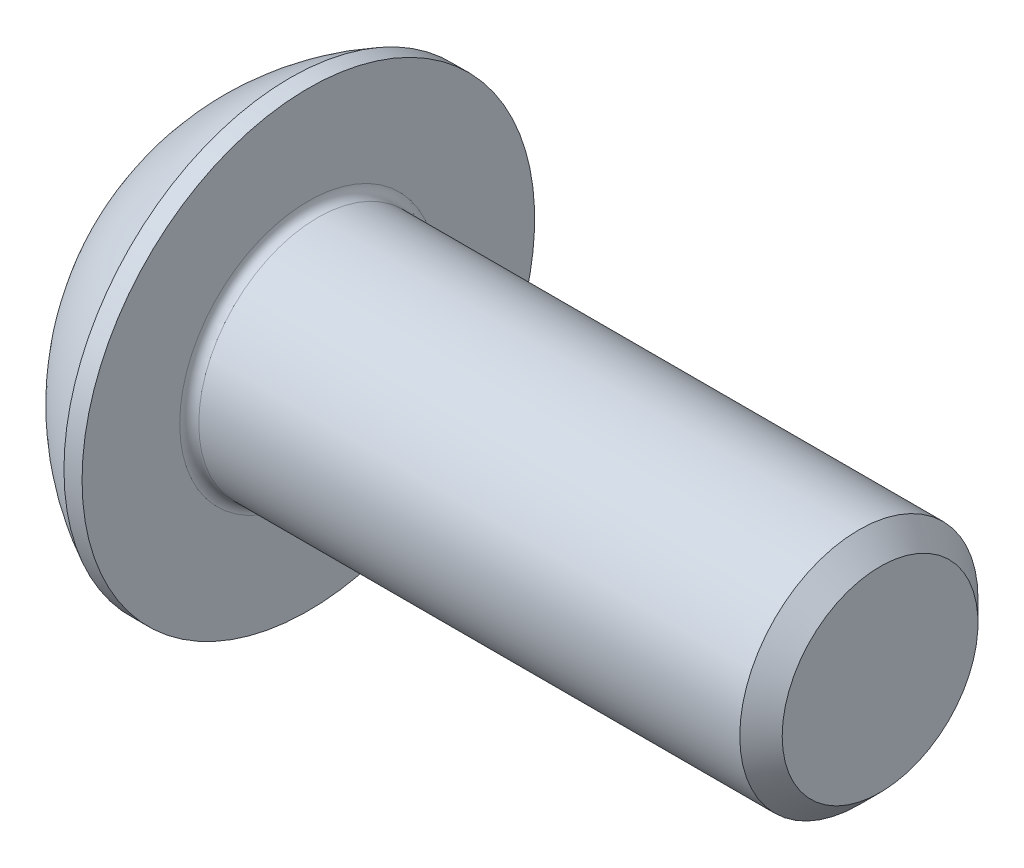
ISO-10303-21;
HEADER;
FILE_DESCRIPTION(('STEP AP214'),'2;1');
FILE_NAME('part.step','',(''),(''),'','','');
FILE_SCHEMA(('AUTOMOTIVE_DESIGN { 1 0 10303 214 1 1 1 1 }'));
ENDSEC;
DATA;
#1=APPLICATION_CONTEXT('core data for automotive mechanical design processes');
#2=APPLICATION_PROTOCOL_DEFINITION('international standard','automotive_design',2000,#1);
#3=PRODUCT_CONTEXT('',#1,'mechanical');
#4=PRODUCT('Part','Part','',(#3));
#5=PRODUCT_RELATED_PRODUCT_CATEGORY('part','',(#4));
#6=PRODUCT_DEFINITION_FORMATION('','',#4);
#7=PRODUCT_DEFINITION_CONTEXT('part definition',#1,'design');
#8=PRODUCT_DEFINITION('design','',#6,#7);
#9=PRODUCT_DEFINITION_SHAPE('','',#8);
#10=(LENGTH_UNIT() NAMED_UNIT(*) SI_UNIT(.MILLI.,.METRE.));
#11=(NAMED_UNIT(*) PLANE_ANGLE_UNIT() SI_UNIT($,.RADIAN.));
#12=(NAMED_UNIT(*) SI_UNIT($,.STERADIAN.) SOLID_ANGLE_UNIT());
#13=UNCERTAINTY_MEASURE_WITH_UNIT(LENGTH_MEASURE(1.E-05),#10,'distance_accuracy_value','');
#14=(GEOMETRIC_REPRESENTATION_CONTEXT(3) GLOBAL_UNCERTAINTY_ASSIGNED_CONTEXT((#13)) GLOBAL_UNIT_ASSIGNED_CONTEXT((#10,
#11,#12)) REPRESENTATION_CONTEXT('',''));
#15=CARTESIAN_POINT('',(0.,0.,0.));
#16=DIRECTION('',(0.,0.,1.));
#17=DIRECTION('',(1.,0.,0.));
#18=AXIS2_PLACEMENT_3D('',#15,#16,#17);
#19=CARTESIAN_POINT('',(0.,0.,0.));
#20=DIRECTION('',(-1.,0.,0.));
#21=DIRECTION('',(0.,0.,1.));
#22=AXIS2_PLACEMENT_3D('',#19,#20,#21);
#23=PLANE('',#22);
#24=CARTESIAN_POINT('',(0.,0.,0.));
#25=DIRECTION('',(-1.,0.,0.));
#26=DIRECTION('',(0.,0.,1.));
#27=AXIS2_PLACEMENT_3D('',#24,#25,#26);
#28=CIRCLE('',#27,2.375);
#29=CARTESIAN_POINT('',(0.,2.375,0.));
#30=VERTEX_POINT('',#29);
#31=EDGE_CURVE('E161',#30,#30,#28,.T.);
#32=ORIENTED_EDGE('',*,*,#31,.T.);
#33=EDGE_LOOP('',(#32));
#34=FACE_BOUND('',#33,.T.);
#35=DIRECTION('',(0.,-1.,0.));
#36=VECTOR('',#35,1.);
#37=CARTESIAN_POINT('',(0.,-0.866025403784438,1.5));
#38=LINE('',#37,#36);
#39=CARTESIAN_POINT('',(0.,0.86602540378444,1.5));
#40=VERTEX_POINT('',#39);
#41=CARTESIAN_POINT('',(0.,-0.866025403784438,1.5));
#42=VERTEX_POINT('',#41);
#43=EDGE_CURVE('E56',#40,#42,#38,.T.);
#44=ORIENTED_EDGE('',*,*,#43,.T.);
#45=DIRECTION('',(0.,-0.5,-0.866025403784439));
#46=VECTOR('',#45,1.);
#47=CARTESIAN_POINT('',(0.,-1.73205080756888,0.));
#48=LINE('',#47,#46);
#49=CARTESIAN_POINT('',(0.,-1.73205080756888,0.));
#50=VERTEX_POINT('',#49);
#51=EDGE_CURVE('E282',#42,#50,#48,.T.);
#52=ORIENTED_EDGE('',*,*,#51,.T.);
#53=DIRECTION('',(0.,0.5,-0.866025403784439));
#54=VECTOR('',#53,1.);
#55=CARTESIAN_POINT('',(0.,-0.866025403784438,-1.5));
#56=LINE('',#55,#54);
#57=CARTESIAN_POINT('',(0.,-0.866025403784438,-1.5));
#58=VERTEX_POINT('',#57);
#59=EDGE_CURVE('E136',#50,#58,#56,.T.);
#60=ORIENTED_EDGE('',*,*,#59,.T.);
#61=DIRECTION('',(0.,1.,0.));
#62=VECTOR('',#61,1.);
#63=CARTESIAN_POINT('',(0.,0.86602540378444,-1.5));
#64=LINE('',#63,#62);
#65=CARTESIAN_POINT('',(0.,0.86602540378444,-1.5));
#66=VERTEX_POINT('',#65);
#67=EDGE_CURVE('E285',#58,#66,#64,.T.);
#68=ORIENTED_EDGE('',*,*,#67,.T.);
#69=DIRECTION('',(0.,0.5,0.866025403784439));
#70=VECTOR('',#69,1.);
#71=CARTESIAN_POINT('',(0.,1.73205080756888,0.));
#72=LINE('',#71,#70);
#73=CARTESIAN_POINT('',(0.,1.73205080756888,0.));
#74=VERTEX_POINT('',#73);
#75=EDGE_CURVE('E287',#66,#74,#72,.T.);
#76=ORIENTED_EDGE('',*,*,#75,.T.);
#77=DIRECTION('',(0.,-0.5,0.866025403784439));
#78=VECTOR('',#77,1.);
#79=CARTESIAN_POINT('',(0.,0.86602540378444,1.5));
#80=LINE('',#79,#78);
#81=EDGE_CURVE('E289',#74,#40,#80,.T.);
#82=ORIENTED_EDGE('',*,*,#81,.T.);
#83=EDGE_LOOP('',(#44,#52,#60,#68,#76,#82));
#84=FACE_BOUND('',#83,.T.);
#85=ADVANCED_FACE('F41',(#34,#84),#23,.T.);
#86=CARTESIAN_POINT('',(4.75501582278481,0.,0.));
#87=DIRECTION('',(-1.,0.,0.));
#88=DIRECTION('',(0.,1.,0.));
#89=AXIS2_PLACEMENT_3D('',#86,#87,#88);
#90=SPHERICAL_SURFACE('',#89,5.3151482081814);
#91=CARTESIAN_POINT('',(2.37,0.,0.));
#92=DIRECTION('',(-1.,0.,0.));
#93=DIRECTION('',(0.,0.,1.));
#94=AXIS2_PLACEMENT_3D('',#91,#92,#93);
#95=CIRCLE('',#94,4.75);
#96=CARTESIAN_POINT('',(2.37,4.75,0.));
#97=VERTEX_POINT('',#96);
#98=EDGE_CURVE('E158',#97,#97,#95,.T.);
#99=CARTESIAN_POINT('',(2.37,4.75,0.));
#100=CARTESIAN_POINT('',(2.33822259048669,4.7340443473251,0.));
#101=CARTESIAN_POINT('',(2.30660534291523,4.71776971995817,0.));
#102=CARTESIAN_POINT('',(2.24370380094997,4.68458927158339,0.));
#103=CARTESIAN_POINT('',(2.21241950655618,4.66768345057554,0.));
#104=CARTESIAN_POINT('',(2.15019650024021,4.6332473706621,0.));
#105=CARTESIAN_POINT('',(2.11925778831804,4.6157171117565,0.));
#106=CARTESIAN_POINT('',(2.05773840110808,4.58003923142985,0.));
#107=CARTESIAN_POINT('',(2.02715772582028,4.56189161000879,0.));
#108=CARTESIAN_POINT('',(1.96636673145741,4.52498631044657,0.));
#109=CARTESIAN_POINT('',(1.93615641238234,4.50622863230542,0.));
#110=CARTESIAN_POINT('',(1.87611829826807,4.46811077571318,0.));
#111=CARTESIAN_POINT('',(1.84629050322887,4.4487505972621,0.));
#112=CARTESIAN_POINT('',(1.78702945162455,4.40943553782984,0.));
#113=CARTESIAN_POINT('',(1.75759619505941,4.38948065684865,0.));
#114=CARTESIAN_POINT('',(1.69913607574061,4.34898423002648,0.));
#115=CARTESIAN_POINT('',(1.67010921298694,4.32844268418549,0.));
#116=CARTESIAN_POINT('',(1.61247357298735,4.28678120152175,0.));
#117=CARTESIAN_POINT('',(1.58386479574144,4.265661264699,0.));
#118=CARTESIAN_POINT('',(1.52707685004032,4.22285150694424,0.));
#119=CARTESIAN_POINT('',(1.49889768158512,4.20116168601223,0.));
#120=CARTESIAN_POINT('',(1.44298030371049,4.15722089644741,0.));
#121=CARTESIAN_POINT('',(1.41524209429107,4.13496992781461,0.));
#122=CARTESIAN_POINT('',(1.36021780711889,4.08991580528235,0.));
#123=CARTESIAN_POINT('',(1.33293172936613,4.06711265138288,0.));
#124=CARTESIAN_POINT('',(1.278822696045,4.02096334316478,0.));
#125=CARTESIAN_POINT('',(1.25199974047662,3.99761718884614,0.));
#126=CARTESIAN_POINT('',(1.19882775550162,3.95039128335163,0.));
#127=CARTESIAN_POINT('',(1.172478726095,3.92651153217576,0.));
#128=CARTESIAN_POINT('',(1.1202652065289,3.87822805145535,0.));
#129=CARTESIAN_POINT('',(1.09440071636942,3.85382432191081,0.));
#130=CARTESIAN_POINT('',(1.04316669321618,3.8045027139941,0.));
#131=CARTESIAN_POINT('',(1.01779716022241,3.77958483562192,0.));
#132=CARTESIAN_POINT('',(0.967563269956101,3.72924496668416,0.));
#133=CARTESIAN_POINT('',(0.942698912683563,3.70382297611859,0.));
#134=CARTESIAN_POINT('',(0.89348538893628,3.65248512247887,0.));
#135=CARTESIAN_POINT('',(0.869136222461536,3.62656925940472,0.));
#136=CARTESIAN_POINT('',(0.82096288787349,3.57425409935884,0.));
#137=CARTESIAN_POINT('',(0.797138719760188,3.54785480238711,0.));
#138=CARTESIAN_POINT('',(0.750024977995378,3.49458340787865,0.));
#139=CARTESIAN_POINT('',(0.726735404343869,3.46771131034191,0.));
#140=CARTESIAN_POINT('',(0.680700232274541,3.41350513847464,0.));
#141=CARTESIAN_POINT('',(0.657954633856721,3.3861710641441,0.));
#142=CARTESIAN_POINT('',(0.613016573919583,3.33105194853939,0.));
#143=CARTESIAN_POINT('',(0.590824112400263,3.30326690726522,0.));
#144=CARTESIAN_POINT('',(0.547001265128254,3.24725704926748,0.));
#145=CARTESIAN_POINT('',(0.525370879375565,3.21903223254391,0.));
#146=CARTESIAN_POINT('',(0.482680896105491,3.16215419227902,0.));
#147=CARTESIAN_POINT('',(0.461621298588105,3.13350096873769,0.));
#148=CARTESIAN_POINT('',(0.420081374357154,3.07577765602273,0.));
#149=CARTESIAN_POINT('',(0.399601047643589,3.04670756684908,0.));
#150=CARTESIAN_POINT('',(0.359227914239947,2.98816223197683,0.));
#151=CARTESIAN_POINT('',(0.339335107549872,2.95868698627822,0.));
#152=CARTESIAN_POINT('',(0.300145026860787,2.89934321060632,0.));
#153=CARTESIAN_POINT('',(0.280847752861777,2.86947468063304,0.));
#154=CARTESIAN_POINT('',(0.242856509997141,2.80935636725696,0.));
#155=CARTESIAN_POINT('',(0.224162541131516,2.77910658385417,0.));
#156=CARTESIAN_POINT('',(0.187385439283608,2.71823794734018,0.));
#157=CARTESIAN_POINT('',(0.169302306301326,2.68761909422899,0.));
#158=CARTESIAN_POINT('',(0.13375415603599,2.626024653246,0.));
#159=CARTESIAN_POINT('',(0.116289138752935,2.59504906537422,0.));
#160=CARTESIAN_POINT('',(0.0819842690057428,2.53275362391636,0.));
#161=CARTESIAN_POINT('',(0.0651444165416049,2.50143377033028,0.));
#162=CARTESIAN_POINT('',(0.0320966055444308,2.43846244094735,0.));
#163=CARTESIAN_POINT('',(0.0158886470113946,2.4068109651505,0.));
#164=CARTESIAN_POINT('',(0.,2.375,0.));
#165=B_SPLINE_CURVE_WITH_KNOTS('',3,(#99,#100,#101,#102,#103,#104,#105,#106,#107,#108,#109,#110,
#111,#112,#113,#114,#115,#116,#117,#118,#119,#120,#121,#122,#123,#124,#125,#126,#127,#128,#129,
#130,#131,#132,#133,#134,#135,#136,#137,#138,#139,#140,#141,#142,#143,#144,#145,#146,#147,#148,
#149,#150,#151,#152,#153,#154,#155,#156,#157,#158,#159,#160,#161,#162,#163,#164),.UNSPECIFIED.,
.F.,.F.,(4,2,2,2,2,2,2,2,2,2,2,2,2,2,2,2,2,2,2,2,2,2,2,2,2,2,2,2,2,2,2,2,4),(0.,
0.106672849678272,0.213345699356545,0.320018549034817,0.42669139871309,0.533364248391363,
0.640037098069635,0.746709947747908,0.85338279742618,0.960055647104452,1.06672849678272,
1.173401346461,1.28007419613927,1.38674704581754,1.49341989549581,1.60009274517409,
1.70676559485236,1.81343844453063,1.9201112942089,2.02678414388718,2.13345699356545,
2.24012984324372,2.34680269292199,2.45347554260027,2.56014839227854,2.66682124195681,
2.77349409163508,2.88016694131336,2.98683979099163,3.0935126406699,3.20018549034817,
3.30685834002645,3.41353118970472),.UNSPECIFIED.);
#166=EDGE_CURVE('BSEAM183',#97,#30,#165,.T.);
#167=ORIENTED_EDGE('',*,*,#98,.T.);
#168=ORIENTED_EDGE('',*,*,#31,.F.);
#169=ORIENTED_EDGE('',*,*,#166,.T.);
#170=ORIENTED_EDGE('',*,*,#166,.F.);
#171=EDGE_LOOP('',(#167,#169,#168,#170));
#172=FACE_BOUND('',#171,.T.);
#173=ADVANCED_FACE('F183',(#172),#90,.T.);
#174=CARTESIAN_POINT('',(0.,0.,0.));
#175=DIRECTION('',(-1.,0.,0.));
#176=DIRECTION('',(0.,0.,1.));
#177=AXIS2_PLACEMENT_3D('',#174,#175,#176);
#178=CYLINDRICAL_SURFACE('',#177,4.75);
#179=ORIENTED_EDGE('',*,*,#98,.F.);
#180=EDGE_LOOP('',(#179));
#181=FACE_BOUND('',#180,.T.);
#182=CARTESIAN_POINT('',(2.75,0.,0.));
#183=DIRECTION('',(-1.,0.,0.));
#184=DIRECTION('',(0.,0.,1.));
#185=AXIS2_PLACEMENT_3D('',#182,#183,#184);
#186=CIRCLE('',#185,4.75);
#187=CARTESIAN_POINT('',(2.75,0.,4.75));
#188=VERTEX_POINT('',#187);
#189=EDGE_CURVE('E155',#188,#188,#186,.T.);
#190=ORIENTED_EDGE('',*,*,#189,.T.);
#191=EDGE_LOOP('',(#190));
#192=FACE_BOUND('',#191,.T.);
#193=ADVANCED_FACE('F188',(#181,#192),#178,.T.);
#194=CARTESIAN_POINT('',(2.75,2.5,0.));
#195=DIRECTION('',(-1.,0.,0.));
#196=DIRECTION('',(0.,0.,1.));
#197=AXIS2_PLACEMENT_3D('',#194,#195,#196);
#198=PLANE('',#197);
#199=CARTESIAN_POINT('',(2.75,0.,0.));
#200=DIRECTION('',(-1.,0.,0.));
#201=DIRECTION('',(0.,0.,1.));
#202=AXIS2_PLACEMENT_3D('',#199,#200,#201);
#203=CIRCLE('',#202,2.7);
#204=CARTESIAN_POINT('',(2.75,0.,2.7));
#205=VERTEX_POINT('',#204);
#206=EDGE_CURVE('E49',#205,#205,#203,.T.);
#207=ORIENTED_EDGE('',*,*,#206,.T.);
#208=EDGE_LOOP('',(#207));
#209=FACE_BOUND('',#208,.T.);
#210=ORIENTED_EDGE('',*,*,#189,.F.);
#211=EDGE_LOOP('',(#210));
#212=FACE_BOUND('',#211,.T.);
#213=ADVANCED_FACE('F166',(#209,#212),#198,.F.);
#214=CARTESIAN_POINT('',(0.,0.,0.));
#215=DIRECTION('',(-1.,0.,0.));
#216=DIRECTION('',(0.,0.,1.));
#217=AXIS2_PLACEMENT_3D('',#214,#215,#216);
#218=CYLINDRICAL_SURFACE('',#217,2.5);
#219=CARTESIAN_POINT('',(2.95,0.,0.));
#220=DIRECTION('',(-1.,0.,0.));
#221=DIRECTION('',(0.,0.,1.));
#222=AXIS2_PLACEMENT_3D('',#219,#220,#221);
#223=CIRCLE('',#222,2.5);
#224=CARTESIAN_POINT('',(2.95,0.,2.5));
#225=VERTEX_POINT('',#224);
#226=EDGE_CURVE('E11',#225,#225,#223,.F.);
#227=ORIENTED_EDGE('',*,*,#226,.T.);
#228=EDGE_LOOP('',(#227));
#229=FACE_BOUND('',#228,.T.);
#230=CARTESIAN_POINT('',(14.305,0.,0.));
#231=DIRECTION('',(-1.,0.,0.));
#232=DIRECTION('',(0.,0.,1.));
#233=AXIS2_PLACEMENT_3D('',#230,#231,#232);
#234=CIRCLE('',#233,2.5);
#235=CARTESIAN_POINT('',(14.305,0.,2.5));
#236=VERTEX_POINT('',#235);
#237=EDGE_CURVE('E152',#236,#236,#234,.T.);
#238=ORIENTED_EDGE('',*,*,#237,.T.);
#239=EDGE_LOOP('',(#238));
#240=FACE_BOUND('',#239,.T.);
#241=ADVANCED_FACE('F197',(#229,#240),#218,.T.);
#242=CARTESIAN_POINT('',(14.75,0.,0.));
#243=DIRECTION('',(-1.,0.,0.));
#244=DIRECTION('',(0.,0.,1.));
#245=AXIS2_PLACEMENT_3D('',#242,#243,#244);
#246=CONICAL_SURFACE('',#245,2.055,0.785398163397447);
#247=ORIENTED_EDGE('',*,*,#237,.F.);
#248=EDGE_LOOP('',(#247));
#249=FACE_BOUND('',#248,.T.);
#250=CARTESIAN_POINT('',(14.75,0.,0.));
#251=DIRECTION('',(-1.,0.,0.));
#252=DIRECTION('',(0.,0.,1.));
#253=AXIS2_PLACEMENT_3D('',#250,#251,#252);
#254=CIRCLE('',#253,2.055);
#255=CARTESIAN_POINT('',(14.75,0.,2.055));
#256=VERTEX_POINT('',#255);
#257=EDGE_CURVE('E148',#256,#256,#254,.T.);
#258=ORIENTED_EDGE('',*,*,#257,.T.);
#259=EDGE_LOOP('',(#258));
#260=FACE_BOUND('',#259,.T.);
#261=ADVANCED_FACE('F179',(#249,#260),#246,.T.);
#262=CARTESIAN_POINT('',(14.75,0.,0.));
#263=DIRECTION('',(-1.,0.,0.));
#264=DIRECTION('',(0.,0.,1.));
#265=AXIS2_PLACEMENT_3D('',#262,#263,#264);
#266=PLANE('',#265);
#267=ORIENTED_EDGE('',*,*,#257,.F.);
#268=EDGE_LOOP('',(#267));
#269=FACE_BOUND('',#268,.T.);
#270=ADVANCED_FACE('F170',(#269),#266,.F.);
#271=CARTESIAN_POINT('',(2.95,0.,0.));
#272=DIRECTION('',(-1.,0.,0.));
#273=DIRECTION('',(0.,0.,1.));
#274=AXIS2_PLACEMENT_3D('',#271,#272,#273);
#275=TOROIDAL_SURFACE('',#274,2.7,0.2);
#276=ORIENTED_EDGE('',*,*,#226,.F.);
#277=EDGE_LOOP('',(#276));
#278=FACE_BOUND('',#277,.T.);
#279=ORIENTED_EDGE('',*,*,#206,.F.);
#280=EDGE_LOOP('',(#279));
#281=FACE_BOUND('',#280,.T.);
#282=ADVANCED_FACE('F43',(#278,#281),#275,.F.);
#283=CARTESIAN_POINT('',(1.56,-1.73205080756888,0.));
#284=DIRECTION('',(0.,0.866025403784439,-0.5));
#285=DIRECTION('',(0.,0.5,0.866025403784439));
#286=AXIS2_PLACEMENT_3D('',#283,#284,#285);
#287=PLANE('',#286);
#288=DIRECTION('',(0.,-0.5,-0.866025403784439));
#289=VECTOR('',#288,1.);
#290=CARTESIAN_POINT('',(1.56,-1.73205080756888,0.));
#291=LINE('',#290,#289);
#292=CARTESIAN_POINT('',(1.56,-0.866025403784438,1.5));
#293=VERTEX_POINT('',#292);
#294=CARTESIAN_POINT('',(1.56,-1.29903810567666,0.749999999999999));
#295=VERTEX_POINT('',#294);
#296=EDGE_CURVE('E122',#293,#295,#291,.T.);
#297=ORIENTED_EDGE('',*,*,#296,.T.);
#298=CARTESIAN_POINT('',(1.56,-1.73205080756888,0.));
#299=VERTEX_POINT('',#298);
#300=EDGE_CURVE('E117',#295,#299,#291,.T.);
#301=ORIENTED_EDGE('',*,*,#300,.T.);
#302=DIRECTION('',(-1.,0.,0.));
#303=VECTOR('',#302,1.);
#304=CARTESIAN_POINT('',(1.56,-1.73205080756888,0.));
#305=LINE('',#304,#303);
#306=EDGE_CURVE('E119',#299,#50,#305,.T.);
#307=ORIENTED_EDGE('',*,*,#306,.T.);
#308=ORIENTED_EDGE('',*,*,#51,.F.);
#309=DIRECTION('',(-1.,0.,0.));
#310=VECTOR('',#309,1.);
#311=CARTESIAN_POINT('',(1.56,-0.866025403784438,1.5));
#312=LINE('',#311,#310);
#313=EDGE_CURVE('E278',#293,#42,#312,.T.);
#314=ORIENTED_EDGE('',*,*,#313,.F.);
#315=EDGE_LOOP('',(#297,#301,#307,#308,#314));
#316=FACE_BOUND('',#315,.T.);
#317=ADVANCED_FACE('F118',(#316),#287,.T.);
#318=CARTESIAN_POINT('',(1.56,-0.866025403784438,-1.5));
#319=DIRECTION('',(0.,0.866025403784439,0.5));
#320=DIRECTION('',(0.,-0.5,0.866025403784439));
#321=AXIS2_PLACEMENT_3D('',#318,#319,#320);
#322=PLANE('',#321);
#323=DIRECTION('',(0.,0.5,-0.866025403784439));
#324=VECTOR('',#323,1.);
#325=CARTESIAN_POINT('',(1.56,-0.866025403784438,-1.5));
#326=LINE('',#325,#324);
#327=CARTESIAN_POINT('',(1.56,-1.29903810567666,-0.749999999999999));
#328=VERTEX_POINT('',#327);
#329=EDGE_CURVE('E64',#299,#328,#326,.T.);
#330=ORIENTED_EDGE('',*,*,#329,.T.);
#331=CARTESIAN_POINT('',(1.56,-0.866025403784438,-1.5));
#332=VERTEX_POINT('',#331);
#333=EDGE_CURVE('E131',#328,#332,#326,.T.);
#334=ORIENTED_EDGE('',*,*,#333,.T.);
#335=DIRECTION('',(-1.,0.,0.));
#336=VECTOR('',#335,1.);
#337=CARTESIAN_POINT('',(1.56,-0.866025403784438,-1.5));
#338=LINE('',#337,#336);
#339=EDGE_CURVE('E138',#332,#58,#338,.T.);
#340=ORIENTED_EDGE('',*,*,#339,.T.);
#341=ORIENTED_EDGE('',*,*,#59,.F.);
#342=ORIENTED_EDGE('',*,*,#306,.F.);
#343=EDGE_LOOP('',(#330,#334,#340,#341,#342));
#344=FACE_BOUND('',#343,.T.);
#345=ADVANCED_FACE('F134',(#344),#322,.T.);
#346=CARTESIAN_POINT('',(1.56,0.86602540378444,-1.5));
#347=DIRECTION('',(0.,0.,1.));
#348=DIRECTION('',(1.,0.,0.));
#349=AXIS2_PLACEMENT_3D('',#346,#347,#348);
#350=PLANE('',#349);
#351=DIRECTION('',(0.,1.,0.));
#352=VECTOR('',#351,1.);
#353=CARTESIAN_POINT('',(1.56,0.86602540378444,-1.5));
#354=LINE('',#353,#352);
#355=CARTESIAN_POINT('',(1.56,0.,-1.5));
#356=VERTEX_POINT('',#355);
#357=EDGE_CURVE('E259',#332,#356,#354,.T.);
#358=ORIENTED_EDGE('',*,*,#357,.T.);
#359=CARTESIAN_POINT('',(1.56,0.86602540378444,-1.5));
#360=VERTEX_POINT('',#359);
#361=EDGE_CURVE('E130',#356,#360,#354,.T.);
#362=ORIENTED_EDGE('',*,*,#361,.T.);
#363=DIRECTION('',(-1.,0.,0.));
#364=VECTOR('',#363,1.);
#365=CARTESIAN_POINT('',(1.56,0.86602540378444,-1.5));
#366=LINE('',#365,#364);
#367=EDGE_CURVE('E143',#360,#66,#366,.T.);
#368=ORIENTED_EDGE('',*,*,#367,.T.);
#369=ORIENTED_EDGE('',*,*,#67,.F.);
#370=ORIENTED_EDGE('',*,*,#339,.F.);
#371=EDGE_LOOP('',(#358,#362,#368,#369,#370));
#372=FACE_BOUND('',#371,.T.);
#373=ADVANCED_FACE('F211',(#372),#350,.T.);
#374=CARTESIAN_POINT('',(1.56,1.73205080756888,0.));
#375=DIRECTION('',(0.,-0.866025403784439,0.5));
#376=DIRECTION('',(0.,-0.5,-0.866025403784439));
#377=AXIS2_PLACEMENT_3D('',#374,#375,#376);
#378=PLANE('',#377);
#379=DIRECTION('',(0.,0.5,0.866025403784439));
#380=VECTOR('',#379,1.);
#381=CARTESIAN_POINT('',(1.56,1.73205080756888,0.));
#382=LINE('',#381,#380);
#383=CARTESIAN_POINT('',(1.56,1.29903810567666,-0.75));
#384=VERTEX_POINT('',#383);
#385=EDGE_CURVE('E248',#360,#384,#382,.T.);
#386=ORIENTED_EDGE('',*,*,#385,.T.);
#387=CARTESIAN_POINT('',(1.56,1.73205080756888,0.));
#388=VERTEX_POINT('',#387);
#389=EDGE_CURVE('E253',#384,#388,#382,.T.);
#390=ORIENTED_EDGE('',*,*,#389,.T.);
#391=DIRECTION('',(-1.,0.,0.));
#392=VECTOR('',#391,1.);
#393=CARTESIAN_POINT('',(1.56,1.73205080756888,0.));
#394=LINE('',#393,#392);
#395=EDGE_CURVE('E293',#388,#74,#394,.T.);
#396=ORIENTED_EDGE('',*,*,#395,.T.);
#397=ORIENTED_EDGE('',*,*,#75,.F.);
#398=ORIENTED_EDGE('',*,*,#367,.F.);
#399=EDGE_LOOP('',(#386,#390,#396,#397,#398));
#400=FACE_BOUND('',#399,.T.);
#401=ADVANCED_FACE('F214',(#400),#378,.T.);
#402=CARTESIAN_POINT('',(1.56,0.86602540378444,1.5));
#403=DIRECTION('',(0.,-0.866025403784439,-0.5));
#404=DIRECTION('',(0.,0.5,-0.866025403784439));
#405=AXIS2_PLACEMENT_3D('',#402,#403,#404);
#406=PLANE('',#405);
#407=DIRECTION('',(0.,-0.5,0.866025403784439));
#408=VECTOR('',#407,1.);
#409=CARTESIAN_POINT('',(1.56,0.86602540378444,1.5));
#410=LINE('',#409,#408);
#411=CARTESIAN_POINT('',(1.56,1.29903810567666,0.75));
#412=VERTEX_POINT('',#411);
#413=EDGE_CURVE('E256',#388,#412,#410,.T.);
#414=ORIENTED_EDGE('',*,*,#413,.T.);
#415=CARTESIAN_POINT('',(1.56,0.86602540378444,1.5));
#416=VERTEX_POINT('',#415);
#417=EDGE_CURVE('E264',#412,#416,#410,.T.);
#418=ORIENTED_EDGE('',*,*,#417,.T.);
#419=DIRECTION('',(-1.,0.,0.));
#420=VECTOR('',#419,1.);
#421=CARTESIAN_POINT('',(1.56,0.86602540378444,1.5));
#422=LINE('',#421,#420);
#423=EDGE_CURVE('E277',#416,#40,#422,.T.);
#424=ORIENTED_EDGE('',*,*,#423,.T.);
#425=ORIENTED_EDGE('',*,*,#81,.F.);
#426=ORIENTED_EDGE('',*,*,#395,.F.);
#427=EDGE_LOOP('',(#414,#418,#424,#425,#426));
#428=FACE_BOUND('',#427,.T.);
#429=ADVANCED_FACE('F218',(#428),#406,.T.);
#430=CARTESIAN_POINT('',(1.56,-0.866025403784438,1.5));
#431=DIRECTION('',(0.,0.,-1.));
#432=DIRECTION('',(-1.,0.,0.));
#433=AXIS2_PLACEMENT_3D('',#430,#431,#432);
#434=PLANE('',#433);
#435=DIRECTION('',(0.,-1.,0.));
#436=VECTOR('',#435,1.);
#437=CARTESIAN_POINT('',(1.56,-0.866025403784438,1.5));
#438=LINE('',#437,#436);
#439=CARTESIAN_POINT('',(1.56,0.,1.5));
#440=VERTEX_POINT('',#439);
#441=EDGE_CURVE('E270',#416,#440,#438,.T.);
#442=ORIENTED_EDGE('',*,*,#441,.T.);
#443=EDGE_CURVE('E272',#440,#293,#438,.T.);
#444=ORIENTED_EDGE('',*,*,#443,.T.);
#445=ORIENTED_EDGE('',*,*,#313,.T.);
#446=ORIENTED_EDGE('',*,*,#43,.F.);
#447=ORIENTED_EDGE('',*,*,#423,.F.);
#448=EDGE_LOOP('',(#442,#444,#445,#446,#447));
#449=FACE_BOUND('',#448,.T.);
#450=ADVANCED_FACE('F222',(#449),#434,.T.);
#451=CARTESIAN_POINT('',(1.56,-2.59807621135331,-1.5));
#452=DIRECTION('',(1.,0.,0.));
#453=DIRECTION('',(0.,0.,-1.));
#454=AXIS2_PLACEMENT_3D('',#451,#452,#453);
#455=PLANE('',#454);
#456=CARTESIAN_POINT('',(1.56,0.,0.));
#457=DIRECTION('',(-1.,0.,0.));
#458=DIRECTION('',(0.,0.,1.));
#459=AXIS2_PLACEMENT_3D('',#456,#457,#458);
#460=CIRCLE('',#459,1.5);
#461=EDGE_CURVE('E245',#384,#356,#460,.T.);
#462=ORIENTED_EDGE('',*,*,#461,.F.);
#463=ORIENTED_EDGE('',*,*,#385,.F.);
#464=ORIENTED_EDGE('',*,*,#361,.F.);
#465=EDGE_LOOP('',(#462,#463,#464));
#466=FACE_BOUND('',#465,.T.);
#467=ADVANCED_FACE('F226',(#466),#455,.F.);
#468=EDGE_CURVE('E149',#412,#384,#460,.T.);
#469=ORIENTED_EDGE('',*,*,#468,.F.);
#470=ORIENTED_EDGE('',*,*,#413,.F.);
#471=ORIENTED_EDGE('',*,*,#389,.F.);
#472=EDGE_LOOP('',(#469,#470,#471));
#473=FACE_BOUND('',#472,.T.);
#474=ADVANCED_FACE('F235',(#473),#455,.F.);
#475=EDGE_CURVE('E142',#440,#412,#460,.T.);
#476=ORIENTED_EDGE('',*,*,#475,.F.);
#477=ORIENTED_EDGE('',*,*,#441,.F.);
#478=ORIENTED_EDGE('',*,*,#417,.F.);
#479=EDGE_LOOP('',(#476,#477,#478));
#480=FACE_BOUND('',#479,.T.);
#481=ADVANCED_FACE('F240',(#480),#455,.F.);
#482=EDGE_CURVE('E137',#295,#440,#460,.T.);
#483=ORIENTED_EDGE('',*,*,#482,.F.);
#484=ORIENTED_EDGE('',*,*,#296,.F.);
#485=ORIENTED_EDGE('',*,*,#443,.F.);
#486=EDGE_LOOP('',(#483,#484,#485));
#487=FACE_BOUND('',#486,.T.);
#488=ADVANCED_FACE('F233',(#487),#455,.F.);
#489=EDGE_CURVE('E128',#328,#295,#460,.T.);
#490=ORIENTED_EDGE('',*,*,#489,.F.);
#491=ORIENTED_EDGE('',*,*,#329,.F.);
#492=ORIENTED_EDGE('',*,*,#300,.F.);
#493=EDGE_LOOP('',(#490,#491,#492));
#494=FACE_BOUND('',#493,.T.);
#495=ADVANCED_FACE('F127',(#494),#455,.F.);
#496=EDGE_CURVE('E251',#356,#328,#460,.T.);
#497=ORIENTED_EDGE('',*,*,#496,.F.);
#498=ORIENTED_EDGE('',*,*,#357,.F.);
#499=ORIENTED_EDGE('',*,*,#333,.F.);
#500=EDGE_LOOP('',(#497,#498,#499));
#501=FACE_BOUND('',#500,.T.);
#502=ADVANCED_FACE('F206',(#501),#455,.F.);
#503=CARTESIAN_POINT('',(2.42602540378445,0.,0.));
#504=DIRECTION('',(-1.,0.,0.));
#505=DIRECTION('',(0.,0.,1.));
#506=AXIS2_PLACEMENT_3D('',#503,#504,#505);
#507=CONICAL_SURFACE('',#506,0.,1.04719755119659);
#508=ORIENTED_EDGE('',*,*,#475,.T.);
#509=ORIENTED_EDGE('',*,*,#468,.T.);
#510=ORIENTED_EDGE('',*,*,#461,.T.);
#511=ORIENTED_EDGE('',*,*,#496,.T.);
#512=ORIENTED_EDGE('',*,*,#489,.T.);
#513=ORIENTED_EDGE('',*,*,#482,.T.);
#514=EDGE_LOOP('',(#508,#509,#510,#511,#512,#513));
#515=FACE_BOUND('',#514,.T.);
#516=CARTESIAN_POINT('',(2.42602540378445,0.,0.));
#517=VERTEX_POINT('',#516);
#518=VERTEX_LOOP('',#517);
#519=FACE_BOUND('',#518,.T.);
#520=ADVANCED_FACE('F204',(#515,#519),#507,.F.);
#521=CLOSED_SHELL('',(#85,#173,#193,#213,#241,#261,#270,#282,#317,#345,#373,#401,#429,#450,#467,
#474,#481,#488,#495,#502,#520));
#522=MANIFOLD_SOLID_BREP('B2',#521);
#523=ADVANCED_BREP_SHAPE_REPRESENTATION('',(#18,#522),#14);
#524=SHAPE_DEFINITION_REPRESENTATION(#9,#523);
ENDSEC;
END-ISO-10303-21;
